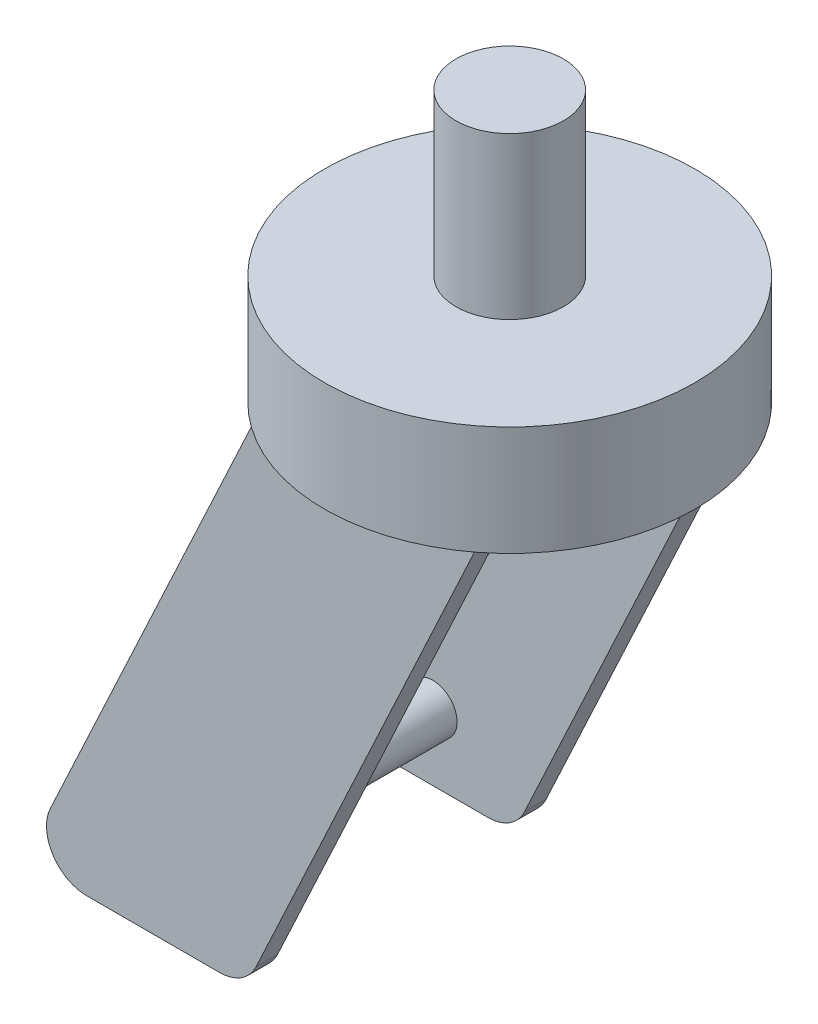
ISO-10303-21;
HEADER;
FILE_DESCRIPTION(('STEP AP214'),'2;1');
FILE_NAME('part.step','',(''),(''),'','','');
FILE_SCHEMA(('AUTOMOTIVE_DESIGN { 1 0 10303 214 1 1 1 1 }'));
ENDSEC;
DATA;
#1=APPLICATION_CONTEXT('core data for automotive mechanical design processes');
#2=APPLICATION_PROTOCOL_DEFINITION('international standard','automotive_design',2000,#1);
#3=PRODUCT_CONTEXT('',#1,'mechanical');
#4=PRODUCT('Part','Part','',(#3));
#5=PRODUCT_RELATED_PRODUCT_CATEGORY('part','',(#4));
#6=PRODUCT_DEFINITION_FORMATION('','',#4);
#7=PRODUCT_DEFINITION_CONTEXT('part definition',#1,'design');
#8=PRODUCT_DEFINITION('design','',#6,#7);
#9=PRODUCT_DEFINITION_SHAPE('','',#8);
#10=(LENGTH_UNIT() NAMED_UNIT(*) SI_UNIT(.MILLI.,.METRE.));
#11=(NAMED_UNIT(*) PLANE_ANGLE_UNIT() SI_UNIT($,.RADIAN.));
#12=(NAMED_UNIT(*) SI_UNIT($,.STERADIAN.) SOLID_ANGLE_UNIT());
#13=UNCERTAINTY_MEASURE_WITH_UNIT(LENGTH_MEASURE(1.E-05),#10,'distance_accuracy_value','');
#14=(GEOMETRIC_REPRESENTATION_CONTEXT(3) GLOBAL_UNCERTAINTY_ASSIGNED_CONTEXT((#13)) GLOBAL_UNIT_ASSIGNED_CONTEXT((#10,
#11,#12)) REPRESENTATION_CONTEXT('',''));
#15=CARTESIAN_POINT('',(0.,0.,0.));
#16=DIRECTION('',(0.,0.,1.));
#17=DIRECTION('',(1.,0.,0.));
#18=AXIS2_PLACEMENT_3D('',#15,#16,#17);
#19=CARTESIAN_POINT('',(8.19443985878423E-12,-2388.8761024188,0.));
#20=DIRECTION('',(0.,-1.,0.));
#21=DIRECTION('',(1.,0.,0.));
#22=AXIS2_PLACEMENT_3D('',#19,#20,#21);
#23=CYLINDRICAL_SURFACE('',#22,51.41);
#24=DIRECTION('',(0.,-1.,0.));
#25=VECTOR('',#24,1.);
#26=CARTESIAN_POINT('',(-22.9562213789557,-2388.8761024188,-46.));
#27=LINE('',#26,#25);
#28=CARTESIAN_POINT('',(-22.9562213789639,0.,-46.));
#29=VERTEX_POINT('',#28);
#30=CARTESIAN_POINT('',(-22.956221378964,8.99999999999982,-46.));
#31=VERTEX_POINT('',#30);
#32=EDGE_CURVE('E11',#29,#31,#27,.F.);
#33=ORIENTED_EDGE('',*,*,#32,.F.);
#34=CARTESIAN_POINT('',(0.,0.,0.));
#35=DIRECTION('',(0.,-1.,0.));
#36=DIRECTION('',(1.,0.,0.));
#37=AXIS2_PLACEMENT_3D('',#34,#35,#36);
#38=CIRCLE('',#37,51.41);
#39=CARTESIAN_POINT('',(-22.9562213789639,4.44089209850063E-13,46.));
#40=VERTEX_POINT('',#39);
#41=EDGE_CURVE('E256',#40,#29,#38,.T.);
#42=ORIENTED_EDGE('',*,*,#41,.F.);
#43=DIRECTION('',(0.,-1.,0.));
#44=VECTOR('',#43,1.);
#45=CARTESIAN_POINT('',(-22.9562213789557,-2388.8761024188,46.));
#46=LINE('',#45,#44);
#47=CARTESIAN_POINT('',(-22.956221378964,8.99999999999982,46.));
#48=VERTEX_POINT('',#47);
#49=EDGE_CURVE('E275',#48,#40,#46,.T.);
#50=ORIENTED_EDGE('',*,*,#49,.F.);
#51=CARTESIAN_POINT('',(0.,8.9999999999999,0.));
#52=DIRECTION('',(0.,-1.,0.));
#53=DIRECTION('',(1.,0.,0.));
#54=AXIS2_PLACEMENT_3D('',#51,#52,#53);
#55=CIRCLE('',#54,51.41);
#56=EDGE_CURVE('E260',#48,#31,#55,.T.);
#57=ORIENTED_EDGE('',*,*,#56,.T.);
#58=EDGE_LOOP('',(#33,#42,#50,#57));
#59=FACE_BOUND('',#58,.T.);
#60=ADVANCED_FACE('F32',(#59),#23,.T.);
#61=CARTESIAN_POINT('',(51.41,0.,0.));
#62=DIRECTION('',(0.,-1.,0.));
#63=DIRECTION('',(1.,0.,0.));
#64=AXIS2_PLACEMENT_3D('',#61,#62,#63);
#65=PLANE('',#64);
#66=DIRECTION('',(-1.,0.,0.));
#67=VECTOR('',#66,1.);
#68=CARTESIAN_POINT('',(51.41,0.,-46.));
#69=LINE('',#68,#67);
#70=CARTESIAN_POINT('',(22.9562213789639,4.44089209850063E-13,-46.));
#71=VERTEX_POINT('',#70);
#72=EDGE_CURVE('E194',#71,#29,#69,.T.);
#73=ORIENTED_EDGE('',*,*,#72,.F.);
#74=CARTESIAN_POINT('',(22.9562213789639,0.,46.));
#75=VERTEX_POINT('',#74);
#76=EDGE_CURVE('E255',#71,#75,#38,.T.);
#77=ORIENTED_EDGE('',*,*,#76,.T.);
#78=DIRECTION('',(1.,0.,0.));
#79=VECTOR('',#78,1.);
#80=CARTESIAN_POINT('',(51.41,0.,46.));
#81=LINE('',#80,#79);
#82=EDGE_CURVE('E242',#40,#75,#81,.T.);
#83=ORIENTED_EDGE('',*,*,#82,.F.);
#84=ORIENTED_EDGE('',*,*,#41,.T.);
#85=EDGE_LOOP('',(#73,#77,#83,#84));
#86=FACE_BOUND('',#85,.T.);
#87=ADVANCED_FACE('F34',(#86),#65,.T.);
#88=CARTESIAN_POINT('',(0.,109.8,0.));
#89=DIRECTION('',(0.,1.,0.));
#90=DIRECTION('',(-1.,0.,0.));
#91=AXIS2_PLACEMENT_3D('',#88,#89,#90);
#92=PLANE('',#91);
#93=CARTESIAN_POINT('',(-3.76641340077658E-13,109.8,0.));
#94=DIRECTION('',(0.,-1.,0.));
#95=DIRECTION('',(1.,0.,0.));
#96=AXIS2_PLACEMENT_3D('',#93,#94,#95);
#97=CIRCLE('',#96,20.0000000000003);
#98=CARTESIAN_POINT('',(20.,109.8,0.));
#99=VERTEX_POINT('',#98);
#100=EDGE_CURVE('E272',#99,#99,#97,.T.);
#101=ORIENTED_EDGE('',*,*,#100,.F.);
#102=EDGE_LOOP('',(#101));
#103=FACE_BOUND('',#102,.T.);
#104=ADVANCED_FACE('F330',(#103),#92,.T.);
#105=CARTESIAN_POINT('',(8.19443985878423E-12,-2388.8761024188,0.));
#106=DIRECTION('',(0.,-1.,0.));
#107=DIRECTION('',(1.,0.,0.));
#108=AXIS2_PLACEMENT_3D('',#105,#106,#107);
#109=CYLINDRICAL_SURFACE('',#108,20.0000000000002);
#110=ORIENTED_EDGE('',*,*,#100,.T.);
#111=EDGE_LOOP('',(#110));
#112=FACE_BOUND('',#111,.T.);
#113=CARTESIAN_POINT('',(-1.70826400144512E-13,49.7999999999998,0.));
#114=DIRECTION('',(0.,-1.,0.));
#115=DIRECTION('',(1.,0.,0.));
#116=AXIS2_PLACEMENT_3D('',#113,#114,#115);
#117=CIRCLE('',#116,20.0000000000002);
#118=CARTESIAN_POINT('',(20.,49.7999999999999,0.));
#119=VERTEX_POINT('',#118);
#120=EDGE_CURVE('E269',#119,#119,#117,.T.);
#121=ORIENTED_EDGE('',*,*,#120,.F.);
#122=EDGE_LOOP('',(#121));
#123=FACE_BOUND('',#122,.T.);
#124=ADVANCED_FACE('F351',(#112,#123),#109,.T.);
#125=CARTESIAN_POINT('',(20.,49.7999999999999,0.));
#126=DIRECTION('',(0.,1.,0.));
#127=DIRECTION('',(-1.,0.,0.));
#128=AXIS2_PLACEMENT_3D('',#125,#126,#127);
#129=PLANE('',#128);
#130=ORIENTED_EDGE('',*,*,#120,.T.);
#131=EDGE_LOOP('',(#130));
#132=FACE_BOUND('',#131,.T.);
#133=CARTESIAN_POINT('',(-1.7082640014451E-13,49.7999999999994,0.));
#134=DIRECTION('',(0.,-1.,0.));
#135=DIRECTION('',(1.,0.,0.));
#136=AXIS2_PLACEMENT_3D('',#133,#134,#135);
#137=CIRCLE('',#136,69.0000000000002);
#138=CARTESIAN_POINT('',(69.,49.7999999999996,0.));
#139=VERTEX_POINT('',#138);
#140=EDGE_CURVE('E266',#139,#139,#137,.T.);
#141=ORIENTED_EDGE('',*,*,#140,.F.);
#142=EDGE_LOOP('',(#141));
#143=FACE_BOUND('',#142,.T.);
#144=ADVANCED_FACE('F345',(#132,#143),#129,.T.);
#145=CARTESIAN_POINT('',(8.19443985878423E-12,-2388.8761024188,0.));
#146=DIRECTION('',(0.,-1.,0.));
#147=DIRECTION('',(1.,0.,0.));
#148=AXIS2_PLACEMENT_3D('',#145,#146,#147);
#149=CYLINDRICAL_SURFACE('',#148,69.0000000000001);
#150=ORIENTED_EDGE('',*,*,#140,.T.);
#151=EDGE_LOOP('',(#150));
#152=FACE_BOUND('',#151,.T.);
#153=CARTESIAN_POINT('',(0.,8.99999999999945,0.));
#154=DIRECTION('',(0.,-1.,0.));
#155=DIRECTION('',(1.,0.,0.));
#156=AXIS2_PLACEMENT_3D('',#153,#154,#155);
#157=CIRCLE('',#156,69.0000000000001);
#158=CARTESIAN_POINT('',(69.,8.99999999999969,0.));
#159=VERTEX_POINT('',#158);
#160=EDGE_CURVE('E263',#159,#159,#157,.T.);
#161=ORIENTED_EDGE('',*,*,#160,.F.);
#162=EDGE_LOOP('',(#161));
#163=FACE_BOUND('',#162,.T.);
#164=ADVANCED_FACE('F341',(#152,#163),#149,.T.);
#165=CARTESIAN_POINT('',(69.,9.00000000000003,0.));
#166=DIRECTION('',(0.,-1.,0.));
#167=DIRECTION('',(1.,0.,0.));
#168=AXIS2_PLACEMENT_3D('',#165,#166,#167);
#169=PLANE('',#168);
#170=DIRECTION('',(-1.,0.,0.));
#171=VECTOR('',#170,1.);
#172=CARTESIAN_POINT('',(-41.3,8.99999999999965,-46.));
#173=LINE('',#172,#171);
#174=CARTESIAN_POINT('',(41.2988710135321,8.99999999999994,-46.));
#175=VERTEX_POINT('',#174);
#176=CARTESIAN_POINT('',(22.9562213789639,8.99999999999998,-46.));
#177=VERTEX_POINT('',#176);
#178=EDGE_CURVE('E54',#175,#177,#173,.T.);
#179=ORIENTED_EDGE('',*,*,#178,.F.);
#180=DIRECTION('',(0.,0.,-1.));
#181=VECTOR('',#180,1.);
#182=CARTESIAN_POINT('',(41.2988710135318,8.99999999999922,-46.));
#183=LINE('',#182,#181);
#184=CARTESIAN_POINT('',(41.2988710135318,8.99999999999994,-54.));
#185=VERTEX_POINT('',#184);
#186=EDGE_CURVE('E166',#175,#185,#183,.T.);
#187=ORIENTED_EDGE('',*,*,#186,.T.);
#188=DIRECTION('',(-1.,0.,0.));
#189=VECTOR('',#188,1.);
#190=CARTESIAN_POINT('',(-41.3,8.99999999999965,-54.));
#191=LINE('',#190,#189);
#192=CARTESIAN_POINT('',(-41.3,8.99999999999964,-54.));
#193=VERTEX_POINT('',#192);
#194=EDGE_CURVE('E180',#185,#193,#191,.T.);
#195=ORIENTED_EDGE('',*,*,#194,.T.);
#196=DIRECTION('',(0.,0.,-1.));
#197=VECTOR('',#196,1.);
#198=CARTESIAN_POINT('',(-41.3,8.99999999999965,-46.));
#199=LINE('',#198,#197);
#200=CARTESIAN_POINT('',(-41.3,8.99999999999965,-46.));
#201=VERTEX_POINT('',#200);
#202=EDGE_CURVE('E47',#201,#193,#199,.T.);
#203=ORIENTED_EDGE('',*,*,#202,.F.);
#204=EDGE_CURVE('E170',#31,#201,#173,.T.);
#205=ORIENTED_EDGE('',*,*,#204,.F.);
#206=ORIENTED_EDGE('',*,*,#56,.F.);
#207=DIRECTION('',(-1.,0.,0.));
#208=VECTOR('',#207,1.);
#209=CARTESIAN_POINT('',(-41.3,8.99999999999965,46.));
#210=LINE('',#209,#208);
#211=CARTESIAN_POINT('',(-41.3,8.99999999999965,46.));
#212=VERTEX_POINT('',#211);
#213=EDGE_CURVE('E219',#48,#212,#210,.T.);
#214=ORIENTED_EDGE('',*,*,#213,.T.);
#215=DIRECTION('',(0.,0.,1.));
#216=VECTOR('',#215,1.);
#217=CARTESIAN_POINT('',(-41.3,8.99999999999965,46.));
#218=LINE('',#217,#216);
#219=CARTESIAN_POINT('',(-41.3,8.99999999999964,54.));
#220=VERTEX_POINT('',#219);
#221=EDGE_CURVE('E240',#212,#220,#218,.T.);
#222=ORIENTED_EDGE('',*,*,#221,.T.);
#223=DIRECTION('',(-1.,0.,0.));
#224=VECTOR('',#223,1.);
#225=CARTESIAN_POINT('',(-41.3,8.99999999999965,54.));
#226=LINE('',#225,#224);
#227=CARTESIAN_POINT('',(41.2988710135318,8.99999999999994,54.));
#228=VERTEX_POINT('',#227);
#229=EDGE_CURVE('E207',#228,#220,#226,.T.);
#230=ORIENTED_EDGE('',*,*,#229,.F.);
#231=DIRECTION('',(0.,0.,1.));
#232=VECTOR('',#231,1.);
#233=CARTESIAN_POINT('',(41.2988710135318,8.99999999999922,46.));
#234=LINE('',#233,#232);
#235=CARTESIAN_POINT('',(41.2988710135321,8.99999999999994,46.));
#236=VERTEX_POINT('',#235);
#237=EDGE_CURVE('E243',#236,#228,#234,.T.);
#238=ORIENTED_EDGE('',*,*,#237,.F.);
#239=CARTESIAN_POINT('',(22.9562213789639,8.99999999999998,46.));
#240=VERTEX_POINT('',#239);
#241=EDGE_CURVE('E220',#236,#240,#210,.T.);
#242=ORIENTED_EDGE('',*,*,#241,.T.);
#243=EDGE_CURVE('E259',#177,#240,#55,.T.);
#244=ORIENTED_EDGE('',*,*,#243,.F.);
#245=EDGE_LOOP('',(#179,#187,#195,#203,#205,#206,#214,#222,#230,#238,#242,#244));
#246=FACE_BOUND('',#245,.T.);
#247=ORIENTED_EDGE('',*,*,#160,.T.);
#248=EDGE_LOOP('',(#247));
#249=FACE_BOUND('',#248,.T.);
#250=ADVANCED_FACE('F285',(#246,#249),#169,.T.);
#251=DIRECTION('',(0.,-1.,0.));
#252=VECTOR('',#251,1.);
#253=CARTESIAN_POINT('',(22.9562213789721,-2388.8761024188,-46.));
#254=LINE('',#253,#252);
#255=EDGE_CURVE('E40',#177,#71,#254,.T.);
#256=ORIENTED_EDGE('',*,*,#255,.F.);
#257=ORIENTED_EDGE('',*,*,#243,.T.);
#258=DIRECTION('',(0.,-1.,0.));
#259=VECTOR('',#258,1.);
#260=CARTESIAN_POINT('',(22.9562213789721,-2388.8761024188,46.));
#261=LINE('',#260,#259);
#262=EDGE_CURVE('E278',#75,#240,#261,.F.);
#263=ORIENTED_EDGE('',*,*,#262,.F.);
#264=ORIENTED_EDGE('',*,*,#76,.F.);
#265=EDGE_LOOP('',(#256,#257,#263,#264));
#266=FACE_BOUND('',#265,.T.);
#267=ADVANCED_FACE('F283',(#266),#23,.T.);
#268=CARTESIAN_POINT('',(-117.149942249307,-153.66072607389,46.));
#269=DIRECTION('',(-0.906307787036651,0.422618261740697,0.));
#270=DIRECTION('',(-0.422618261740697,-0.906307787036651,0.));
#271=AXIS2_PLACEMENT_3D('',#268,#269,#270);
#272=PLANE('',#271);
#273=DIRECTION('',(-0.422618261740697,-0.906307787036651,0.));
#274=VECTOR('',#273,1.);
#275=CARTESIAN_POINT('',(-117.149942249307,-153.66072607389,54.));
#276=LINE('',#275,#274);
#277=CARTESIAN_POINT('',(-117.149942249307,-153.66072607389,54.));
#278=VERTEX_POINT('',#277);
#279=EDGE_CURVE('E202',#220,#278,#276,.T.);
#280=ORIENTED_EDGE('',*,*,#279,.F.);
#281=ORIENTED_EDGE('',*,*,#221,.F.);
#282=DIRECTION('',(-0.422618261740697,-0.906307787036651,0.));
#283=VECTOR('',#282,1.);
#284=CARTESIAN_POINT('',(-117.149942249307,-153.66072607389,46.));
#285=LINE('',#284,#283);
#286=CARTESIAN_POINT('',(-117.149942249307,-153.66072607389,46.));
#287=VERTEX_POINT('',#286);
#288=EDGE_CURVE('E203',#212,#287,#285,.T.);
#289=ORIENTED_EDGE('',*,*,#288,.T.);
#290=DIRECTION('',(0.,0.,1.));
#291=VECTOR('',#290,1.);
#292=CARTESIAN_POINT('',(-117.149942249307,-153.66072607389,46.));
#293=LINE('',#292,#291);
#294=EDGE_CURVE('E223',#287,#278,#293,.T.);
#295=ORIENTED_EDGE('',*,*,#294,.T.);
#296=EDGE_LOOP('',(#280,#281,#289,#295));
#297=FACE_BOUND('',#296,.T.);
#298=ADVANCED_FACE('F334',(#297),#272,.T.);
#299=CARTESIAN_POINT('',(41.2988710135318,8.99999999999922,46.));
#300=DIRECTION('',(0.906307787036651,-0.422618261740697,0.));
#301=DIRECTION('',(0.422618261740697,0.906307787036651,0.));
#302=AXIS2_PLACEMENT_3D('',#299,#300,#301);
#303=PLANE('',#302);
#304=DIRECTION('',(0.422618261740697,0.906307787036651,0.));
#305=VECTOR('',#304,1.);
#306=CARTESIAN_POINT('',(41.2988710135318,8.99999999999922,54.));
#307=LINE('',#306,#305);
#308=CARTESIAN_POINT('',(-40.4631751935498,-166.339273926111,54.));
#309=VERTEX_POINT('',#308);
#310=EDGE_CURVE('E235',#309,#228,#307,.T.);
#311=ORIENTED_EDGE('',*,*,#310,.F.);
#312=DIRECTION('',(0.,0.,1.));
#313=VECTOR('',#312,1.);
#314=CARTESIAN_POINT('',(-40.4631751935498,-166.339273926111,46.));
#315=LINE('',#314,#313);
#316=CARTESIAN_POINT('',(-40.4631751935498,-166.339273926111,46.));
#317=VERTEX_POINT('',#316);
#318=EDGE_CURVE('E246',#317,#309,#315,.T.);
#319=ORIENTED_EDGE('',*,*,#318,.F.);
#320=DIRECTION('',(0.422618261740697,0.906307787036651,0.));
#321=VECTOR('',#320,1.);
#322=CARTESIAN_POINT('',(41.2988710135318,8.99999999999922,46.));
#323=LINE('',#322,#321);
#324=EDGE_CURVE('E216',#317,#236,#323,.T.);
#325=ORIENTED_EDGE('',*,*,#324,.T.);
#326=ORIENTED_EDGE('',*,*,#237,.T.);
#327=EDGE_LOOP('',(#311,#319,#325,#326));
#328=FACE_BOUND('',#327,.T.);
#329=ADVANCED_FACE('F339',(#328),#303,.T.);
#330=CARTESIAN_POINT('',(-54.0577919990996,-160.,46.));
#331=DIRECTION('',(0.,0.,1.));
#332=DIRECTION('',(1.,0.,0.));
#333=AXIS2_PLACEMENT_3D('',#330,#331,#332);
#334=CYLINDRICAL_SURFACE('',#333,15.);
#335=CARTESIAN_POINT('',(-54.0577919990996,-160.,54.));
#336=DIRECTION('',(0.,0.,1.));
#337=DIRECTION('',(-1.,0.,0.));
#338=AXIS2_PLACEMENT_3D('',#335,#336,#337);
#339=CIRCLE('',#338,15.);
#340=CARTESIAN_POINT('',(-54.0577919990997,-175.,54.));
#341=VERTEX_POINT('',#340);
#342=EDGE_CURVE('E232',#341,#309,#339,.T.);
#343=ORIENTED_EDGE('',*,*,#342,.F.);
#344=DIRECTION('',(0.,0.,1.));
#345=VECTOR('',#344,1.);
#346=CARTESIAN_POINT('',(-54.0577919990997,-175.,46.));
#347=LINE('',#346,#345);
#348=CARTESIAN_POINT('',(-54.0577919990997,-175.,46.));
#349=VERTEX_POINT('',#348);
#350=EDGE_CURVE('E248',#349,#341,#347,.T.);
#351=ORIENTED_EDGE('',*,*,#350,.F.);
#352=CARTESIAN_POINT('',(-54.0577919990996,-160.,46.));
#353=DIRECTION('',(0.,0.,1.));
#354=DIRECTION('',(-1.,0.,0.));
#355=AXIS2_PLACEMENT_3D('',#352,#353,#354);
#356=CIRCLE('',#355,15.);
#357=EDGE_CURVE('E213',#349,#317,#356,.T.);
#358=ORIENTED_EDGE('',*,*,#357,.T.);
#359=ORIENTED_EDGE('',*,*,#318,.T.);
#360=EDGE_LOOP('',(#343,#351,#358,#359));
#361=FACE_BOUND('',#360,.T.);
#362=ADVANCED_FACE('F397',(#361),#334,.T.);
#363=CARTESIAN_POINT('',(-54.0577919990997,-175.,46.));
#364=DIRECTION('',(0.,-1.,0.));
#365=DIRECTION('',(0.,0.,-1.));
#366=AXIS2_PLACEMENT_3D('',#363,#364,#365);
#367=PLANE('',#366);
#368=DIRECTION('',(1.,0.,0.));
#369=VECTOR('',#368,1.);
#370=CARTESIAN_POINT('',(-54.0577919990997,-175.,54.));
#371=LINE('',#370,#369);
#372=CARTESIAN_POINT('',(-103.555325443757,-175.,54.));
#373=VERTEX_POINT('',#372);
#374=EDGE_CURVE('E229',#373,#341,#371,.T.);
#375=ORIENTED_EDGE('',*,*,#374,.F.);
#376=DIRECTION('',(0.,0.,1.));
#377=VECTOR('',#376,1.);
#378=CARTESIAN_POINT('',(-103.555325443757,-175.,46.));
#379=LINE('',#378,#377);
#380=CARTESIAN_POINT('',(-103.555325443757,-175.,46.));
#381=VERTEX_POINT('',#380);
#382=EDGE_CURVE('E250',#381,#373,#379,.T.);
#383=ORIENTED_EDGE('',*,*,#382,.F.);
#384=DIRECTION('',(1.,0.,0.));
#385=VECTOR('',#384,1.);
#386=CARTESIAN_POINT('',(-54.0577919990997,-175.,46.));
#387=LINE('',#386,#385);
#388=EDGE_CURVE('E210',#381,#349,#387,.T.);
#389=ORIENTED_EDGE('',*,*,#388,.T.);
#390=ORIENTED_EDGE('',*,*,#350,.T.);
#391=EDGE_LOOP('',(#375,#383,#389,#390));
#392=FACE_BOUND('',#391,.T.);
#393=ADVANCED_FACE('F321',(#392),#367,.T.);
#394=CARTESIAN_POINT('',(-103.555325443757,-160.,46.));
#395=DIRECTION('',(0.,0.,1.));
#396=DIRECTION('',(1.,0.,0.));
#397=AXIS2_PLACEMENT_3D('',#394,#395,#396);
#398=CYLINDRICAL_SURFACE('',#397,15.);
#399=CARTESIAN_POINT('',(-103.555325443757,-160.,54.));
#400=DIRECTION('',(0.,0.,1.));
#401=DIRECTION('',(-1.,0.,0.));
#402=AXIS2_PLACEMENT_3D('',#399,#400,#401);
#403=CIRCLE('',#402,15.);
#404=EDGE_CURVE('E226',#278,#373,#403,.T.);
#405=ORIENTED_EDGE('',*,*,#404,.F.);
#406=ORIENTED_EDGE('',*,*,#294,.F.);
#407=CARTESIAN_POINT('',(-103.555325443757,-160.,46.));
#408=DIRECTION('',(0.,0.,1.));
#409=DIRECTION('',(-1.,0.,0.));
#410=AXIS2_PLACEMENT_3D('',#407,#408,#409);
#411=CIRCLE('',#410,15.);
#412=EDGE_CURVE('E206',#287,#381,#411,.T.);
#413=ORIENTED_EDGE('',*,*,#412,.T.);
#414=ORIENTED_EDGE('',*,*,#382,.T.);
#415=EDGE_LOOP('',(#405,#406,#413,#414));
#416=FACE_BOUND('',#415,.T.);
#417=ADVANCED_FACE('F313',(#416),#398,.T.);
#418=CARTESIAN_POINT('',(-54.0577919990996,-160.,46.));
#419=DIRECTION('',(0.,0.,-1.));
#420=DIRECTION('',(-1.,0.,0.));
#421=AXIS2_PLACEMENT_3D('',#418,#419,#420);
#422=PLANE('',#421);
#423=CARTESIAN_POINT('',(-74.59,-150.,46.));
#424=DIRECTION('',(0.,0.,-1.));
#425=DIRECTION('',(-1.,0.,0.));
#426=AXIS2_PLACEMENT_3D('',#423,#424,#425);
#427=CIRCLE('',#426,9.);
#428=CARTESIAN_POINT('',(-83.59,-150.,46.));
#429=VERTEX_POINT('',#428);
#430=EDGE_CURVE('E305',#429,#429,#427,.T.);
#431=ORIENTED_EDGE('',*,*,#430,.F.);
#432=EDGE_LOOP('',(#431));
#433=FACE_BOUND('',#432,.T.);
#434=ORIENTED_EDGE('',*,*,#82,.T.);
#435=ORIENTED_EDGE('',*,*,#262,.T.);
#436=ORIENTED_EDGE('',*,*,#241,.F.);
#437=ORIENTED_EDGE('',*,*,#324,.F.);
#438=ORIENTED_EDGE('',*,*,#357,.F.);
#439=ORIENTED_EDGE('',*,*,#388,.F.);
#440=ORIENTED_EDGE('',*,*,#412,.F.);
#441=ORIENTED_EDGE('',*,*,#288,.F.);
#442=ORIENTED_EDGE('',*,*,#213,.F.);
#443=ORIENTED_EDGE('',*,*,#49,.T.);
#444=EDGE_LOOP('',(#434,#435,#436,#437,#438,#439,#440,#441,#442,#443));
#445=FACE_BOUND('',#444,.T.);
#446=ADVANCED_FACE('F290',(#433,#445),#422,.T.);
#447=CARTESIAN_POINT('',(-54.0577919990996,-160.,54.));
#448=DIRECTION('',(0.,0.,-1.));
#449=DIRECTION('',(-1.,0.,0.));
#450=AXIS2_PLACEMENT_3D('',#447,#448,#449);
#451=PLANE('',#450);
#452=ORIENTED_EDGE('',*,*,#279,.T.);
#453=ORIENTED_EDGE('',*,*,#404,.T.);
#454=ORIENTED_EDGE('',*,*,#374,.T.);
#455=ORIENTED_EDGE('',*,*,#342,.T.);
#456=ORIENTED_EDGE('',*,*,#310,.T.);
#457=ORIENTED_EDGE('',*,*,#229,.T.);
#458=EDGE_LOOP('',(#452,#453,#454,#455,#456,#457));
#459=FACE_BOUND('',#458,.T.);
#460=ADVANCED_FACE('F312',(#459),#451,.F.);
#461=CARTESIAN_POINT('',(-117.149942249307,-153.66072607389,-46.));
#462=DIRECTION('',(0.906307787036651,-0.422618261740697,0.));
#463=DIRECTION('',(0.422618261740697,0.906307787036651,0.));
#464=AXIS2_PLACEMENT_3D('',#461,#462,#463);
#465=PLANE('',#464);
#466=DIRECTION('',(-0.422618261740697,-0.906307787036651,0.));
#467=VECTOR('',#466,1.);
#468=CARTESIAN_POINT('',(-117.149942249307,-153.66072607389,-54.));
#469=LINE('',#468,#467);
#470=CARTESIAN_POINT('',(-117.149942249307,-153.66072607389,-54.));
#471=VERTEX_POINT('',#470);
#472=EDGE_CURVE('E177',#193,#471,#469,.T.);
#473=ORIENTED_EDGE('',*,*,#472,.T.);
#474=DIRECTION('',(0.,0.,-1.));
#475=VECTOR('',#474,1.);
#476=CARTESIAN_POINT('',(-117.149942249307,-153.66072607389,-46.));
#477=LINE('',#476,#475);
#478=CARTESIAN_POINT('',(-117.149942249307,-153.66072607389,-46.));
#479=VERTEX_POINT('',#478);
#480=EDGE_CURVE('E191',#479,#471,#477,.T.);
#481=ORIENTED_EDGE('',*,*,#480,.F.);
#482=DIRECTION('',(-0.422618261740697,-0.906307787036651,0.));
#483=VECTOR('',#482,1.);
#484=CARTESIAN_POINT('',(-117.149942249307,-153.66072607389,-46.));
#485=LINE('',#484,#483);
#486=EDGE_CURVE('E190',#201,#479,#485,.T.);
#487=ORIENTED_EDGE('',*,*,#486,.F.);
#488=ORIENTED_EDGE('',*,*,#202,.T.);
#489=EDGE_LOOP('',(#473,#481,#487,#488));
#490=FACE_BOUND('',#489,.T.);
#491=ADVANCED_FACE('F300',(#490),#465,.F.);
#492=CARTESIAN_POINT('',(-103.555325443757,-160.,-46.));
#493=DIRECTION('',(0.,0.,-1.));
#494=DIRECTION('',(-1.,0.,0.));
#495=AXIS2_PLACEMENT_3D('',#492,#493,#494);
#496=CYLINDRICAL_SURFACE('',#495,15.);
#497=CARTESIAN_POINT('',(-103.555325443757,-160.,-54.));
#498=DIRECTION('',(0.,0.,1.));
#499=DIRECTION('',(-1.,0.,0.));
#500=AXIS2_PLACEMENT_3D('',#497,#498,#499);
#501=CIRCLE('',#500,15.);
#502=CARTESIAN_POINT('',(-103.555325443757,-175.,-54.));
#503=VERTEX_POINT('',#502);
#504=EDGE_CURVE('E188',#471,#503,#501,.T.);
#505=ORIENTED_EDGE('',*,*,#504,.T.);
#506=DIRECTION('',(0.,0.,-1.));
#507=VECTOR('',#506,1.);
#508=CARTESIAN_POINT('',(-103.555325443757,-175.,-46.));
#509=LINE('',#508,#507);
#510=CARTESIAN_POINT('',(-103.555325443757,-175.,-46.));
#511=VERTEX_POINT('',#510);
#512=EDGE_CURVE('E195',#511,#503,#509,.T.);
#513=ORIENTED_EDGE('',*,*,#512,.F.);
#514=CARTESIAN_POINT('',(-103.555325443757,-160.,-46.));
#515=DIRECTION('',(0.,0.,1.));
#516=DIRECTION('',(-1.,0.,0.));
#517=AXIS2_PLACEMENT_3D('',#514,#515,#516);
#518=CIRCLE('',#517,15.);
#519=EDGE_CURVE('E175',#479,#511,#518,.T.);
#520=ORIENTED_EDGE('',*,*,#519,.F.);
#521=ORIENTED_EDGE('',*,*,#480,.T.);
#522=EDGE_LOOP('',(#505,#513,#520,#521));
#523=FACE_BOUND('',#522,.T.);
#524=ADVANCED_FACE('F452',(#523),#496,.T.);
#525=CARTESIAN_POINT('',(-54.0577919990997,-175.,-46.));
#526=DIRECTION('',(0.,1.,0.));
#527=DIRECTION('',(0.,0.,1.));
#528=AXIS2_PLACEMENT_3D('',#525,#526,#527);
#529=PLANE('',#528);
#530=DIRECTION('',(1.,0.,0.));
#531=VECTOR('',#530,1.);
#532=CARTESIAN_POINT('',(-54.0577919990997,-175.,-54.));
#533=LINE('',#532,#531);
#534=CARTESIAN_POINT('',(-54.0577919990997,-175.,-54.));
#535=VERTEX_POINT('',#534);
#536=EDGE_CURVE('E186',#503,#535,#533,.T.);
#537=ORIENTED_EDGE('',*,*,#536,.T.);
#538=DIRECTION('',(0.,0.,-1.));
#539=VECTOR('',#538,1.);
#540=CARTESIAN_POINT('',(-54.0577919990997,-175.,-46.));
#541=LINE('',#540,#539);
#542=CARTESIAN_POINT('',(-54.0577919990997,-175.,-46.));
#543=VERTEX_POINT('',#542);
#544=EDGE_CURVE('E165',#543,#535,#541,.T.);
#545=ORIENTED_EDGE('',*,*,#544,.F.);
#546=DIRECTION('',(1.,0.,0.));
#547=VECTOR('',#546,1.);
#548=CARTESIAN_POINT('',(-54.0577919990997,-175.,-46.));
#549=LINE('',#548,#547);
#550=EDGE_CURVE('E152',#511,#543,#549,.T.);
#551=ORIENTED_EDGE('',*,*,#550,.F.);
#552=ORIENTED_EDGE('',*,*,#512,.T.);
#553=EDGE_LOOP('',(#537,#545,#551,#552));
#554=FACE_BOUND('',#553,.T.);
#555=ADVANCED_FACE('F460',(#554),#529,.F.);
#556=CARTESIAN_POINT('',(-54.0577919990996,-160.,-46.));
#557=DIRECTION('',(0.,0.,-1.));
#558=DIRECTION('',(-1.,0.,0.));
#559=AXIS2_PLACEMENT_3D('',#556,#557,#558);
#560=CYLINDRICAL_SURFACE('',#559,15.);
#561=CARTESIAN_POINT('',(-54.0577919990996,-160.,-54.));
#562=DIRECTION('',(0.,0.,1.));
#563=DIRECTION('',(-1.,0.,0.));
#564=AXIS2_PLACEMENT_3D('',#561,#562,#563);
#565=CIRCLE('',#564,15.);
#566=CARTESIAN_POINT('',(-40.4631751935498,-166.339273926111,-54.));
#567=VERTEX_POINT('',#566);
#568=EDGE_CURVE('E161',#535,#567,#565,.T.);
#569=ORIENTED_EDGE('',*,*,#568,.T.);
#570=DIRECTION('',(0.,0.,-1.));
#571=VECTOR('',#570,1.);
#572=CARTESIAN_POINT('',(-40.4631751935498,-166.339273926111,-46.));
#573=LINE('',#572,#571);
#574=CARTESIAN_POINT('',(-40.4631751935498,-166.339273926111,-46.));
#575=VERTEX_POINT('',#574);
#576=EDGE_CURVE('E158',#575,#567,#573,.T.);
#577=ORIENTED_EDGE('',*,*,#576,.F.);
#578=CARTESIAN_POINT('',(-54.0577919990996,-160.,-46.));
#579=DIRECTION('',(0.,0.,1.));
#580=DIRECTION('',(-1.,0.,0.));
#581=AXIS2_PLACEMENT_3D('',#578,#579,#580);
#582=CIRCLE('',#581,15.);
#583=EDGE_CURVE('E144',#543,#575,#582,.T.);
#584=ORIENTED_EDGE('',*,*,#583,.F.);
#585=ORIENTED_EDGE('',*,*,#544,.T.);
#586=EDGE_LOOP('',(#569,#577,#584,#585));
#587=FACE_BOUND('',#586,.T.);
#588=ADVANCED_FACE('F159',(#587),#560,.T.);
#589=CARTESIAN_POINT('',(41.2988710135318,8.99999999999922,-46.));
#590=DIRECTION('',(-0.906307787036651,0.422618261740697,0.));
#591=DIRECTION('',(-0.422618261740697,-0.906307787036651,0.));
#592=AXIS2_PLACEMENT_3D('',#589,#590,#591);
#593=PLANE('',#592);
#594=DIRECTION('',(0.422618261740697,0.906307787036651,0.));
#595=VECTOR('',#594,1.);
#596=CARTESIAN_POINT('',(41.2988710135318,8.99999999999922,-54.));
#597=LINE('',#596,#595);
#598=EDGE_CURVE('E183',#567,#185,#597,.T.);
#599=ORIENTED_EDGE('',*,*,#598,.T.);
#600=ORIENTED_EDGE('',*,*,#186,.F.);
#601=DIRECTION('',(0.422618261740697,0.906307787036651,0.));
#602=VECTOR('',#601,1.);
#603=CARTESIAN_POINT('',(41.2988710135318,8.99999999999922,-46.));
#604=LINE('',#603,#602);
#605=EDGE_CURVE('E149',#575,#175,#604,.T.);
#606=ORIENTED_EDGE('',*,*,#605,.F.);
#607=ORIENTED_EDGE('',*,*,#576,.T.);
#608=EDGE_LOOP('',(#599,#600,#606,#607));
#609=FACE_BOUND('',#608,.T.);
#610=ADVANCED_FACE('F168',(#609),#593,.F.);
#611=CARTESIAN_POINT('',(-54.0577919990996,-160.,-46.));
#612=DIRECTION('',(0.,0.,1.));
#613=DIRECTION('',(-1.,0.,0.));
#614=AXIS2_PLACEMENT_3D('',#611,#612,#613);
#615=PLANE('',#614);
#616=CARTESIAN_POINT('',(-74.59,-150.,-46.));
#617=DIRECTION('',(0.,0.,1.));
#618=DIRECTION('',(1.,0.,0.));
#619=AXIS2_PLACEMENT_3D('',#616,#617,#618);
#620=CIRCLE('',#619,9.);
#621=CARTESIAN_POINT('',(-65.59,-150.,-46.));
#622=VERTEX_POINT('',#621);
#623=EDGE_CURVE('E181',#622,#622,#620,.T.);
#624=ORIENTED_EDGE('',*,*,#623,.F.);
#625=EDGE_LOOP('',(#624));
#626=FACE_BOUND('',#625,.T.);
#627=ORIENTED_EDGE('',*,*,#72,.T.);
#628=ORIENTED_EDGE('',*,*,#32,.T.);
#629=ORIENTED_EDGE('',*,*,#204,.T.);
#630=ORIENTED_EDGE('',*,*,#486,.T.);
#631=ORIENTED_EDGE('',*,*,#519,.T.);
#632=ORIENTED_EDGE('',*,*,#550,.T.);
#633=ORIENTED_EDGE('',*,*,#583,.T.);
#634=ORIENTED_EDGE('',*,*,#605,.T.);
#635=ORIENTED_EDGE('',*,*,#178,.T.);
#636=ORIENTED_EDGE('',*,*,#255,.T.);
#637=EDGE_LOOP('',(#627,#628,#629,#630,#631,#632,#633,#634,#635,#636));
#638=FACE_BOUND('',#637,.T.);
#639=ADVANCED_FACE('F147',(#626,#638),#615,.T.);
#640=CARTESIAN_POINT('',(-54.0577919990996,-160.,-54.));
#641=DIRECTION('',(0.,0.,1.));
#642=DIRECTION('',(-1.,0.,0.));
#643=AXIS2_PLACEMENT_3D('',#640,#641,#642);
#644=PLANE('',#643);
#645=ORIENTED_EDGE('',*,*,#472,.F.);
#646=ORIENTED_EDGE('',*,*,#194,.F.);
#647=ORIENTED_EDGE('',*,*,#598,.F.);
#648=ORIENTED_EDGE('',*,*,#568,.F.);
#649=ORIENTED_EDGE('',*,*,#536,.F.);
#650=ORIENTED_EDGE('',*,*,#504,.F.);
#651=EDGE_LOOP('',(#645,#646,#647,#648,#649,#650));
#652=FACE_BOUND('',#651,.T.);
#653=ADVANCED_FACE('F493',(#652),#644,.F.);
#654=CARTESIAN_POINT('',(-74.59,-150.,-71.4558441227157));
#655=DIRECTION('',(0.,0.,1.));
#656=DIRECTION('',(1.,0.,0.));
#657=AXIS2_PLACEMENT_3D('',#654,#655,#656);
#658=CYLINDRICAL_SURFACE('',#657,9.);
#659=ORIENTED_EDGE('',*,*,#623,.T.);
#660=EDGE_LOOP('',(#659));
#661=FACE_BOUND('',#660,.T.);
#662=ORIENTED_EDGE('',*,*,#430,.T.);
#663=EDGE_LOOP('',(#662));
#664=FACE_BOUND('',#663,.T.);
#665=ADVANCED_FACE('F309',(#661,#664),#658,.T.);
#666=CLOSED_SHELL('',(#60,#87,#104,#124,#144,#164,#250,#267,#298,#329,#362,#393,#417,#446,#460,
#491,#524,#555,#588,#610,#639,#653,#665));
#667=MANIFOLD_SOLID_BREP('B2',#666);
#668=ADVANCED_BREP_SHAPE_REPRESENTATION('',(#18,#667),#14);
#669=SHAPE_DEFINITION_REPRESENTATION(#9,#668);
ENDSEC;
END-ISO-10303-21;
